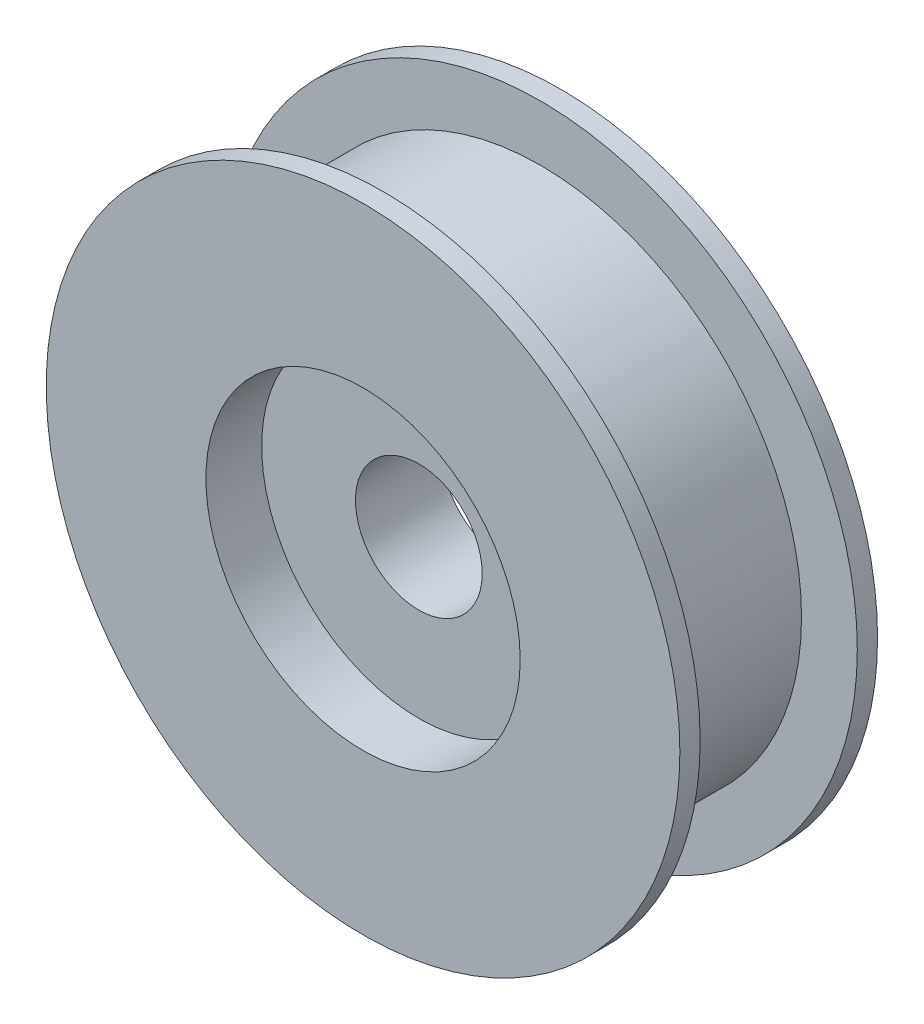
ISO-10303-21;
HEADER;
FILE_DESCRIPTION(('STEP AP214'),'2;1');
FILE_NAME('part.step','',(''),(''),'','','');
FILE_SCHEMA(('AUTOMOTIVE_DESIGN { 1 0 10303 214 1 1 1 1 }'));
ENDSEC;
DATA;
#1=APPLICATION_CONTEXT('core data for automotive mechanical design processes');
#2=APPLICATION_PROTOCOL_DEFINITION('international standard','automotive_design',2000,#1);
#3=PRODUCT_CONTEXT('',#1,'mechanical');
#4=PRODUCT('Part','Part','',(#3));
#5=PRODUCT_RELATED_PRODUCT_CATEGORY('part','',(#4));
#6=PRODUCT_DEFINITION_FORMATION('','',#4);
#7=PRODUCT_DEFINITION_CONTEXT('part definition',#1,'design');
#8=PRODUCT_DEFINITION('design','',#6,#7);
#9=PRODUCT_DEFINITION_SHAPE('','',#8);
#10=(LENGTH_UNIT() NAMED_UNIT(*) SI_UNIT(.MILLI.,.METRE.));
#11=(NAMED_UNIT(*) PLANE_ANGLE_UNIT() SI_UNIT($,.RADIAN.));
#12=(NAMED_UNIT(*) SI_UNIT($,.STERADIAN.) SOLID_ANGLE_UNIT());
#13=UNCERTAINTY_MEASURE_WITH_UNIT(LENGTH_MEASURE(1.E-05),#10,'distance_accuracy_value','');
#14=(GEOMETRIC_REPRESENTATION_CONTEXT(3) GLOBAL_UNCERTAINTY_ASSIGNED_CONTEXT((#13)) GLOBAL_UNIT_ASSIGNED_CONTEXT((#10,
#11,#12)) REPRESENTATION_CONTEXT('',''));
#15=CARTESIAN_POINT('',(0.,0.,0.));
#16=DIRECTION('',(0.,0.,1.));
#17=DIRECTION('',(1.,0.,0.));
#18=AXIS2_PLACEMENT_3D('',#15,#16,#17);
#19=CARTESIAN_POINT('',(0.,62.5,0.));
#20=DIRECTION('',(0.,0.,-1.));
#21=DIRECTION('',(-1.,0.,0.));
#22=AXIS2_PLACEMENT_3D('',#19,#20,#21);
#23=PLANE('',#22);
#24=CARTESIAN_POINT('',(0.,0.,0.));
#25=DIRECTION('',(0.,0.,1.));
#26=DIRECTION('',(1.,0.,0.));
#27=AXIS2_PLACEMENT_3D('',#24,#25,#26);
#28=CIRCLE('',#27,31.);
#29=CARTESIAN_POINT('',(31.,0.,0.));
#30=VERTEX_POINT('',#29);
#31=EDGE_CURVE('E10',#30,#30,#28,.T.);
#32=ORIENTED_EDGE('',*,*,#31,.F.);
#33=EDGE_LOOP('',(#32));
#34=FACE_BOUND('',#33,.T.);
#35=CARTESIAN_POINT('',(0.,0.,0.));
#36=DIRECTION('',(0.,0.,1.));
#37=DIRECTION('',(1.,0.,0.));
#38=AXIS2_PLACEMENT_3D('',#35,#36,#37);
#39=CIRCLE('',#38,62.5);
#40=CARTESIAN_POINT('',(62.5,0.,0.));
#41=VERTEX_POINT('',#40);
#42=EDGE_CURVE('E387',#41,#41,#39,.T.);
#43=ORIENTED_EDGE('',*,*,#42,.T.);
#44=EDGE_LOOP('',(#43));
#45=FACE_BOUND('',#44,.T.);
#46=ADVANCED_FACE('F346',(#34,#45),#23,.F.);
#47=CARTESIAN_POINT('',(0.,0.,8.08520146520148));
#48=DIRECTION('',(0.,0.,1.));
#49=DIRECTION('',(1.,0.,0.));
#50=AXIS2_PLACEMENT_3D('',#47,#48,#49);
#51=CYLINDRICAL_SURFACE('',#50,31.);
#52=CARTESIAN_POINT('',(0.,0.,-11.));
#53=DIRECTION('',(0.,0.,1.));
#54=DIRECTION('',(1.,0.,0.));
#55=AXIS2_PLACEMENT_3D('',#52,#53,#54);
#56=CIRCLE('',#55,31.);
#57=CARTESIAN_POINT('',(31.,0.,-11.));
#58=VERTEX_POINT('',#57);
#59=EDGE_CURVE('E352',#58,#58,#56,.T.);
#60=ORIENTED_EDGE('',*,*,#59,.F.);
#61=EDGE_LOOP('',(#60));
#62=FACE_BOUND('',#61,.T.);
#63=ORIENTED_EDGE('',*,*,#31,.T.);
#64=EDGE_LOOP('',(#63));
#65=FACE_BOUND('',#64,.T.);
#66=ADVANCED_FACE('F448',(#62,#65),#51,.F.);
#67=CARTESIAN_POINT('',(0.,31.,-11.));
#68=DIRECTION('',(0.,0.,-1.));
#69=DIRECTION('',(-1.,0.,0.));
#70=AXIS2_PLACEMENT_3D('',#67,#68,#69);
#71=PLANE('',#70);
#72=CARTESIAN_POINT('',(0.,0.,-11.));
#73=DIRECTION('',(0.,0.,1.));
#74=DIRECTION('',(1.,0.,0.));
#75=AXIS2_PLACEMENT_3D('',#72,#73,#74);
#76=CIRCLE('',#75,12.5);
#77=CARTESIAN_POINT('',(12.5,0.,-11.));
#78=VERTEX_POINT('',#77);
#79=EDGE_CURVE('E356',#78,#78,#76,.T.);
#80=ORIENTED_EDGE('',*,*,#79,.F.);
#81=EDGE_LOOP('',(#80));
#82=FACE_BOUND('',#81,.T.);
#83=ORIENTED_EDGE('',*,*,#59,.T.);
#84=EDGE_LOOP('',(#83));
#85=FACE_BOUND('',#84,.T.);
#86=ADVANCED_FACE('F443',(#82,#85),#71,.F.);
#87=CARTESIAN_POINT('',(0.,0.,8.08520146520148));
#88=DIRECTION('',(0.,0.,1.));
#89=DIRECTION('',(1.,0.,0.));
#90=AXIS2_PLACEMENT_3D('',#87,#88,#89);
#91=CYLINDRICAL_SURFACE('',#90,12.5);
#92=CARTESIAN_POINT('',(0.,0.,-28.));
#93=DIRECTION('',(0.,0.,1.));
#94=DIRECTION('',(1.,0.,0.));
#95=AXIS2_PLACEMENT_3D('',#92,#93,#94);
#96=CIRCLE('',#95,12.5);
#97=CARTESIAN_POINT('',(12.5,0.,-28.));
#98=VERTEX_POINT('',#97);
#99=EDGE_CURVE('E360',#98,#98,#96,.T.);
#100=ORIENTED_EDGE('',*,*,#99,.F.);
#101=EDGE_LOOP('',(#100));
#102=FACE_BOUND('',#101,.T.);
#103=ORIENTED_EDGE('',*,*,#79,.T.);
#104=EDGE_LOOP('',(#103));
#105=FACE_BOUND('',#104,.T.);
#106=ADVANCED_FACE('F437',(#102,#105),#91,.F.);
#107=CARTESIAN_POINT('',(0.,12.5,-28.));
#108=DIRECTION('',(0.,0.,1.));
#109=DIRECTION('',(1.,0.,0.));
#110=AXIS2_PLACEMENT_3D('',#107,#108,#109);
#111=PLANE('',#110);
#112=CARTESIAN_POINT('',(0.,0.,-28.));
#113=DIRECTION('',(0.,0.,1.));
#114=DIRECTION('',(1.,0.,0.));
#115=AXIS2_PLACEMENT_3D('',#112,#113,#114);
#116=CIRCLE('',#115,31.);
#117=CARTESIAN_POINT('',(31.,0.,-28.));
#118=VERTEX_POINT('',#117);
#119=EDGE_CURVE('E365',#118,#118,#116,.T.);
#120=ORIENTED_EDGE('',*,*,#119,.F.);
#121=EDGE_LOOP('',(#120));
#122=FACE_BOUND('',#121,.T.);
#123=ORIENTED_EDGE('',*,*,#99,.T.);
#124=EDGE_LOOP('',(#123));
#125=FACE_BOUND('',#124,.T.);
#126=ADVANCED_FACE('F431',(#122,#125),#111,.F.);
#127=CARTESIAN_POINT('',(0.,0.,8.08520146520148));
#128=DIRECTION('',(0.,0.,1.));
#129=DIRECTION('',(1.,0.,0.));
#130=AXIS2_PLACEMENT_3D('',#127,#128,#129);
#131=CYLINDRICAL_SURFACE('',#130,31.);
#132=CARTESIAN_POINT('',(0.,0.,-39.));
#133=DIRECTION('',(0.,0.,1.));
#134=DIRECTION('',(1.,0.,0.));
#135=AXIS2_PLACEMENT_3D('',#132,#133,#134);
#136=CIRCLE('',#135,31.);
#137=CARTESIAN_POINT('',(31.,0.,-39.));
#138=VERTEX_POINT('',#137);
#139=EDGE_CURVE('E368',#138,#138,#136,.T.);
#140=ORIENTED_EDGE('',*,*,#139,.F.);
#141=EDGE_LOOP('',(#140));
#142=FACE_BOUND('',#141,.T.);
#143=ORIENTED_EDGE('',*,*,#119,.T.);
#144=EDGE_LOOP('',(#143));
#145=FACE_BOUND('',#144,.T.);
#146=ADVANCED_FACE('F425',(#142,#145),#131,.F.);
#147=CARTESIAN_POINT('',(0.,62.5,-39.));
#148=DIRECTION('',(0.,0.,1.));
#149=DIRECTION('',(1.,0.,0.));
#150=AXIS2_PLACEMENT_3D('',#147,#148,#149);
#151=PLANE('',#150);
#152=CARTESIAN_POINT('',(0.,0.,-39.));
#153=DIRECTION('',(0.,0.,1.));
#154=DIRECTION('',(1.,0.,0.));
#155=AXIS2_PLACEMENT_3D('',#152,#153,#154);
#156=CIRCLE('',#155,62.5);
#157=CARTESIAN_POINT('',(62.5,0.,-39.));
#158=VERTEX_POINT('',#157);
#159=EDGE_CURVE('E371',#158,#158,#156,.T.);
#160=ORIENTED_EDGE('',*,*,#159,.F.);
#161=EDGE_LOOP('',(#160));
#162=FACE_BOUND('',#161,.T.);
#163=ORIENTED_EDGE('',*,*,#139,.T.);
#164=EDGE_LOOP('',(#163));
#165=FACE_BOUND('',#164,.T.);
#166=ADVANCED_FACE('F419',(#162,#165),#151,.F.);
#167=CARTESIAN_POINT('',(0.,0.,8.08520146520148));
#168=DIRECTION('',(0.,0.,1.));
#169=DIRECTION('',(1.,0.,0.));
#170=AXIS2_PLACEMENT_3D('',#167,#168,#169);
#171=CYLINDRICAL_SURFACE('',#170,62.5);
#172=CARTESIAN_POINT('',(0.,0.,-35.));
#173=DIRECTION('',(0.,0.,1.));
#174=DIRECTION('',(1.,0.,0.));
#175=AXIS2_PLACEMENT_3D('',#172,#173,#174);
#176=CIRCLE('',#175,62.5);
#177=CARTESIAN_POINT('',(62.5,0.,-35.));
#178=VERTEX_POINT('',#177);
#179=EDGE_CURVE('E375',#178,#178,#176,.T.);
#180=ORIENTED_EDGE('',*,*,#179,.F.);
#181=EDGE_LOOP('',(#180));
#182=FACE_BOUND('',#181,.T.);
#183=ORIENTED_EDGE('',*,*,#159,.T.);
#184=EDGE_LOOP('',(#183));
#185=FACE_BOUND('',#184,.T.);
#186=ADVANCED_FACE('F413',(#182,#185),#171,.T.);
#187=CARTESIAN_POINT('',(0.,51.5,-35.));
#188=DIRECTION('',(0.,0.,-1.));
#189=DIRECTION('',(-1.,0.,0.));
#190=AXIS2_PLACEMENT_3D('',#187,#188,#189);
#191=PLANE('',#190);
#192=CARTESIAN_POINT('',(0.,0.,-35.));
#193=DIRECTION('',(0.,0.,1.));
#194=DIRECTION('',(1.,0.,0.));
#195=AXIS2_PLACEMENT_3D('',#192,#193,#194);
#196=CIRCLE('',#195,51.5);
#197=CARTESIAN_POINT('',(51.5,0.,-35.));
#198=VERTEX_POINT('',#197);
#199=EDGE_CURVE('E378',#198,#198,#196,.T.);
#200=ORIENTED_EDGE('',*,*,#199,.F.);
#201=EDGE_LOOP('',(#200));
#202=FACE_BOUND('',#201,.T.);
#203=ORIENTED_EDGE('',*,*,#179,.T.);
#204=EDGE_LOOP('',(#203));
#205=FACE_BOUND('',#204,.T.);
#206=ADVANCED_FACE('F407',(#202,#205),#191,.F.);
#207=CARTESIAN_POINT('',(0.,0.,8.08520146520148));
#208=DIRECTION('',(0.,0.,1.));
#209=DIRECTION('',(1.,0.,0.));
#210=AXIS2_PLACEMENT_3D('',#207,#208,#209);
#211=CYLINDRICAL_SURFACE('',#210,51.5);
#212=CARTESIAN_POINT('',(0.,0.,-4.));
#213=DIRECTION('',(0.,0.,1.));
#214=DIRECTION('',(1.,0.,0.));
#215=AXIS2_PLACEMENT_3D('',#212,#213,#214);
#216=CIRCLE('',#215,51.5);
#217=CARTESIAN_POINT('',(51.5,0.,-4.));
#218=VERTEX_POINT('',#217);
#219=EDGE_CURVE('E381',#218,#218,#216,.T.);
#220=ORIENTED_EDGE('',*,*,#219,.F.);
#221=EDGE_LOOP('',(#220));
#222=FACE_BOUND('',#221,.T.);
#223=ORIENTED_EDGE('',*,*,#199,.T.);
#224=EDGE_LOOP('',(#223));
#225=FACE_BOUND('',#224,.T.);
#226=ADVANCED_FACE('F401',(#222,#225),#211,.T.);
#227=CARTESIAN_POINT('',(0.,62.5,-4.));
#228=DIRECTION('',(0.,0.,1.));
#229=DIRECTION('',(1.,0.,0.));
#230=AXIS2_PLACEMENT_3D('',#227,#228,#229);
#231=PLANE('',#230);
#232=CARTESIAN_POINT('',(0.,0.,-4.));
#233=DIRECTION('',(0.,0.,1.));
#234=DIRECTION('',(1.,0.,0.));
#235=AXIS2_PLACEMENT_3D('',#232,#233,#234);
#236=CIRCLE('',#235,62.5);
#237=CARTESIAN_POINT('',(62.5,0.,-4.));
#238=VERTEX_POINT('',#237);
#239=EDGE_CURVE('E384',#238,#238,#236,.T.);
#240=ORIENTED_EDGE('',*,*,#239,.F.);
#241=EDGE_LOOP('',(#240));
#242=FACE_BOUND('',#241,.T.);
#243=ORIENTED_EDGE('',*,*,#219,.T.);
#244=EDGE_LOOP('',(#243));
#245=FACE_BOUND('',#244,.T.);
#246=ADVANCED_FACE('F395',(#242,#245),#231,.F.);
#247=CARTESIAN_POINT('',(0.,0.,8.08520146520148));
#248=DIRECTION('',(0.,0.,1.));
#249=DIRECTION('',(1.,0.,0.));
#250=AXIS2_PLACEMENT_3D('',#247,#248,#249);
#251=CYLINDRICAL_SURFACE('',#250,62.5);
#252=ORIENTED_EDGE('',*,*,#42,.F.);
#253=EDGE_LOOP('',(#252));
#254=FACE_BOUND('',#253,.T.);
#255=ORIENTED_EDGE('',*,*,#239,.T.);
#256=EDGE_LOOP('',(#255));
#257=FACE_BOUND('',#256,.T.);
#258=ADVANCED_FACE('F392',(#254,#257),#251,.T.);
#259=CLOSED_SHELL('',(#46,#66,#86,#106,#126,#146,#166,#186,#206,#226,#246,#258));
#260=MANIFOLD_SOLID_BREP('B2',#259);
#261=ADVANCED_BREP_SHAPE_REPRESENTATION('',(#18,#260),#14);
#262=SHAPE_DEFINITION_REPRESENTATION(#9,#261);
ENDSEC;
END-ISO-10303-21;
